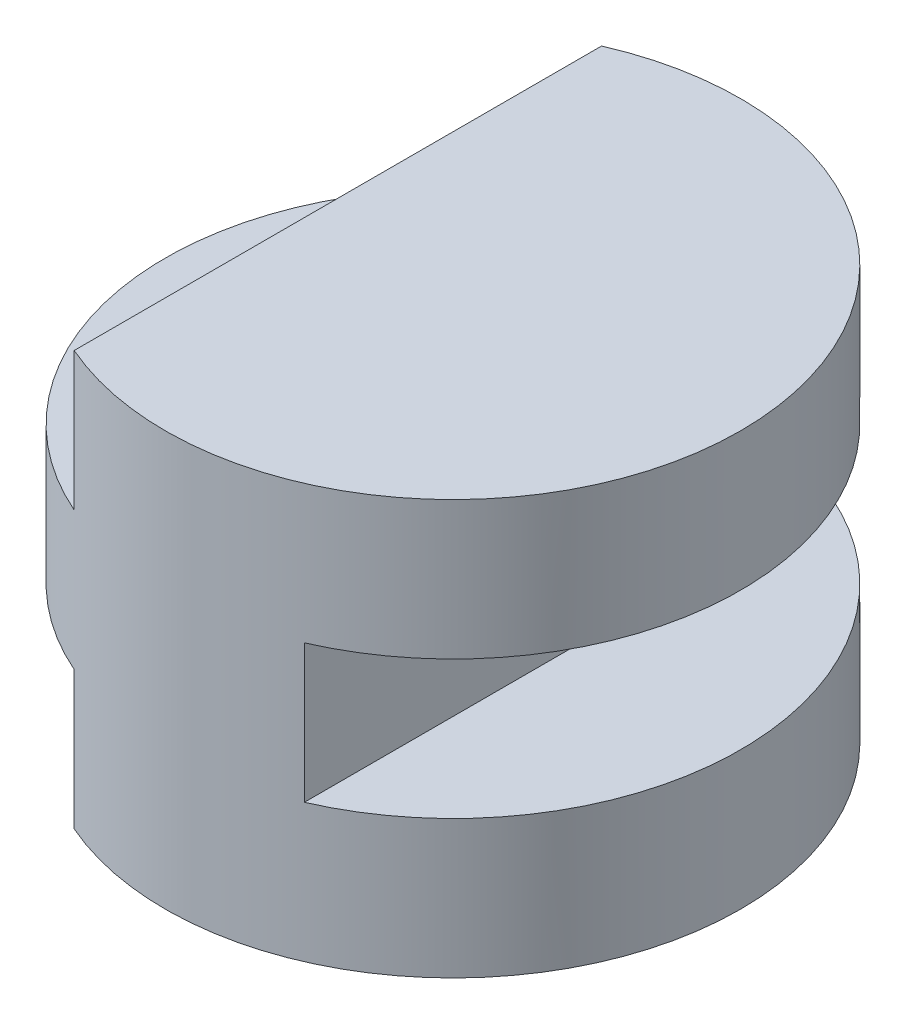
ISO-10303-21;
HEADER;
FILE_DESCRIPTION(('STEP AP214'),'2;1');
FILE_NAME('part.step','',(''),(''),'','','');
FILE_SCHEMA(('AUTOMOTIVE_DESIGN { 1 0 10303 214 1 1 1 1 }'));
ENDSEC;
DATA;
#1=APPLICATION_CONTEXT('core data for automotive mechanical design processes');
#2=APPLICATION_PROTOCOL_DEFINITION('international standard','automotive_design',2000,#1);
#3=PRODUCT_CONTEXT('',#1,'mechanical');
#4=PRODUCT('Part','Part','',(#3));
#5=PRODUCT_RELATED_PRODUCT_CATEGORY('part','',(#4));
#6=PRODUCT_DEFINITION_FORMATION('','',#4);
#7=PRODUCT_DEFINITION_CONTEXT('part definition',#1,'design');
#8=PRODUCT_DEFINITION('design','',#6,#7);
#9=PRODUCT_DEFINITION_SHAPE('','',#8);
#10=(LENGTH_UNIT() NAMED_UNIT(*) SI_UNIT(.MILLI.,.METRE.));
#11=(NAMED_UNIT(*) PLANE_ANGLE_UNIT() SI_UNIT($,.RADIAN.));
#12=(NAMED_UNIT(*) SI_UNIT($,.STERADIAN.) SOLID_ANGLE_UNIT());
#13=UNCERTAINTY_MEASURE_WITH_UNIT(LENGTH_MEASURE(1.E-05),#10,'distance_accuracy_value','');
#14=(GEOMETRIC_REPRESENTATION_CONTEXT(3) GLOBAL_UNCERTAINTY_ASSIGNED_CONTEXT((#13)) GLOBAL_UNIT_ASSIGNED_CONTEXT((#10,
#11,#12)) REPRESENTATION_CONTEXT('',''));
#15=CARTESIAN_POINT('',(0.,0.,0.));
#16=DIRECTION('',(0.,0.,1.));
#17=DIRECTION('',(1.,0.,0.));
#18=AXIS2_PLACEMENT_3D('',#15,#16,#17);
#19=CARTESIAN_POINT('',(0.,72.,0.));
#20=DIRECTION('',(0.,-1.,0.));
#21=DIRECTION('',(0.,0.,-1.));
#22=AXIS2_PLACEMENT_3D('',#19,#20,#21);
#23=CYLINDRICAL_SURFACE('',#22,50.);
#24=CARTESIAN_POINT('',(0.,72.,0.));
#25=DIRECTION('',(0.,1.,0.));
#26=DIRECTION('',(0.,0.,1.));
#27=AXIS2_PLACEMENT_3D('',#24,#25,#26);
#28=CIRCLE('',#27,50.);
#29=CARTESIAN_POINT('',(-20.,72.,45.8257569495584));
#30=VERTEX_POINT('',#29);
#31=CARTESIAN_POINT('',(-20.,72.,-45.8257569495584));
#32=VERTEX_POINT('',#31);
#33=EDGE_CURVE('E108',#30,#32,#28,.T.);
#34=ORIENTED_EDGE('',*,*,#33,.F.);
#35=DIRECTION('',(0.,-1.,0.));
#36=VECTOR('',#35,1.);
#37=CARTESIAN_POINT('',(-20.,72.,45.8257569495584));
#38=LINE('',#37,#36);
#39=CARTESIAN_POINT('',(-20.,48.,45.8257569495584));
#40=VERTEX_POINT('',#39);
#41=EDGE_CURVE('E53',#30,#40,#38,.T.);
#42=ORIENTED_EDGE('',*,*,#41,.T.);
#43=CARTESIAN_POINT('',(0.,48.,0.));
#44=DIRECTION('',(0.,-1.,0.));
#45=DIRECTION('',(0.,0.,-1.));
#46=AXIS2_PLACEMENT_3D('',#43,#44,#45);
#47=CIRCLE('',#46,50.);
#48=CARTESIAN_POINT('',(-20.,48.,-45.8257569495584));
#49=VERTEX_POINT('',#48);
#50=EDGE_CURVE('E126',#40,#49,#47,.T.);
#51=ORIENTED_EDGE('',*,*,#50,.T.);
#52=DIRECTION('',(0.,-1.,0.));
#53=VECTOR('',#52,1.);
#54=CARTESIAN_POINT('',(-20.,72.,-45.8257569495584));
#55=LINE('',#54,#53);
#56=EDGE_CURVE('E99',#49,#32,#55,.F.);
#57=ORIENTED_EDGE('',*,*,#56,.T.);
#58=EDGE_LOOP('',(#34,#42,#51,#57));
#59=FACE_BOUND('',#58,.T.);
#60=DIRECTION('',(0.,-1.,0.));
#61=VECTOR('',#60,1.);
#62=CARTESIAN_POINT('',(20.,72.,45.8257569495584));
#63=LINE('',#62,#61);
#64=CARTESIAN_POINT('',(20.,24.,45.8257569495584));
#65=VERTEX_POINT('',#64);
#66=CARTESIAN_POINT('',(20.,48.,45.8257569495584));
#67=VERTEX_POINT('',#66);
#68=EDGE_CURVE('E115',#65,#67,#63,.F.);
#69=ORIENTED_EDGE('',*,*,#68,.T.);
#70=CARTESIAN_POINT('',(0.,48.,0.));
#71=DIRECTION('',(0.,1.,0.));
#72=DIRECTION('',(0.,0.,1.));
#73=AXIS2_PLACEMENT_3D('',#70,#71,#72);
#74=CIRCLE('',#73,50.);
#75=CARTESIAN_POINT('',(20.,48.,-45.8257569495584));
#76=VERTEX_POINT('',#75);
#77=EDGE_CURVE('E121',#67,#76,#74,.T.);
#78=ORIENTED_EDGE('',*,*,#77,.T.);
#79=DIRECTION('',(0.,-1.,0.));
#80=VECTOR('',#79,1.);
#81=CARTESIAN_POINT('',(20.,72.,-45.8257569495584));
#82=LINE('',#81,#80);
#83=CARTESIAN_POINT('',(20.,24.,-45.8257569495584));
#84=VERTEX_POINT('',#83);
#85=EDGE_CURVE('E118',#76,#84,#82,.T.);
#86=ORIENTED_EDGE('',*,*,#85,.T.);
#87=CARTESIAN_POINT('',(0.,24.,0.));
#88=DIRECTION('',(0.,-1.,0.));
#89=DIRECTION('',(1.,0.,0.));
#90=AXIS2_PLACEMENT_3D('',#87,#88,#89);
#91=CIRCLE('',#90,50.);
#92=EDGE_CURVE('E111',#84,#65,#91,.T.);
#93=ORIENTED_EDGE('',*,*,#92,.T.);
#94=EDGE_LOOP('',(#69,#78,#86,#93));
#95=FACE_BOUND('',#94,.T.);
#96=CARTESIAN_POINT('',(0.,24.,0.));
#97=DIRECTION('',(0.,1.,0.));
#98=DIRECTION('',(-1.,0.,0.));
#99=AXIS2_PLACEMENT_3D('',#96,#97,#98);
#100=CIRCLE('',#99,50.);
#101=CARTESIAN_POINT('',(-20.,24.,-45.8257569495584));
#102=VERTEX_POINT('',#101);
#103=CARTESIAN_POINT('',(-20.,24.,45.8257569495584));
#104=VERTEX_POINT('',#103);
#105=EDGE_CURVE('E11',#102,#104,#100,.T.);
#106=ORIENTED_EDGE('',*,*,#105,.T.);
#107=DIRECTION('',(0.,-1.,0.));
#108=VECTOR('',#107,1.);
#109=CARTESIAN_POINT('',(-20.,72.,45.8257569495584));
#110=LINE('',#109,#108);
#111=CARTESIAN_POINT('',(-20.,0.,45.8257569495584));
#112=VERTEX_POINT('',#111);
#113=EDGE_CURVE('E89',#104,#112,#110,.T.);
#114=ORIENTED_EDGE('',*,*,#113,.T.);
#115=CARTESIAN_POINT('',(0.,0.,0.));
#116=DIRECTION('',(0.,1.,0.));
#117=DIRECTION('',(0.,0.,1.));
#118=AXIS2_PLACEMENT_3D('',#115,#116,#117);
#119=CIRCLE('',#118,50.);
#120=CARTESIAN_POINT('',(-20.,0.,-45.8257569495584));
#121=VERTEX_POINT('',#120);
#122=EDGE_CURVE('E93',#112,#121,#119,.T.);
#123=ORIENTED_EDGE('',*,*,#122,.T.);
#124=DIRECTION('',(0.,-1.,0.));
#125=VECTOR('',#124,1.);
#126=CARTESIAN_POINT('',(-20.,72.,-45.8257569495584));
#127=LINE('',#126,#125);
#128=EDGE_CURVE('E45',#121,#102,#127,.F.);
#129=ORIENTED_EDGE('',*,*,#128,.T.);
#130=EDGE_LOOP('',(#106,#114,#123,#129));
#131=FACE_BOUND('',#130,.T.);
#132=ADVANCED_FACE('F31',(#59,#95,#131),#23,.T.);
#133=CARTESIAN_POINT('',(0.,72.,0.));
#134=DIRECTION('',(0.,1.,0.));
#135=DIRECTION('',(0.,0.,1.));
#136=AXIS2_PLACEMENT_3D('',#133,#134,#135);
#137=PLANE('',#136);
#138=DIRECTION('',(0.,0.,-1.));
#139=VECTOR('',#138,1.);
#140=CARTESIAN_POINT('',(-20.,72.,0.));
#141=LINE('',#140,#139);
#142=EDGE_CURVE('E124',#30,#32,#141,.T.);
#143=ORIENTED_EDGE('',*,*,#142,.F.);
#144=ORIENTED_EDGE('',*,*,#33,.T.);
#145=EDGE_LOOP('',(#143,#144));
#146=FACE_BOUND('',#145,.T.);
#147=ADVANCED_FACE('F132',(#146),#137,.T.);
#148=CARTESIAN_POINT('',(0.,0.,0.));
#149=DIRECTION('',(0.,1.,0.));
#150=DIRECTION('',(0.,0.,1.));
#151=AXIS2_PLACEMENT_3D('',#148,#149,#150);
#152=PLANE('',#151);
#153=ORIENTED_EDGE('',*,*,#122,.F.);
#154=DIRECTION('',(0.,0.,-1.));
#155=VECTOR('',#154,1.);
#156=CARTESIAN_POINT('',(-20.,0.,0.));
#157=LINE('',#156,#155);
#158=EDGE_CURVE('E38',#112,#121,#157,.T.);
#159=ORIENTED_EDGE('',*,*,#158,.T.);
#160=EDGE_LOOP('',(#153,#159));
#161=FACE_BOUND('',#160,.T.);
#162=ADVANCED_FACE('F129',(#161),#152,.F.);
#163=CARTESIAN_POINT('',(20.,48.,-50.));
#164=DIRECTION('',(-1.,0.,0.));
#165=DIRECTION('',(0.,-1.,0.));
#166=AXIS2_PLACEMENT_3D('',#163,#164,#165);
#167=PLANE('',#166);
#168=DIRECTION('',(0.,0.,1.));
#169=VECTOR('',#168,1.);
#170=CARTESIAN_POINT('',(20.,48.,-50.));
#171=LINE('',#170,#169);
#172=EDGE_CURVE('E104',#76,#67,#171,.T.);
#173=ORIENTED_EDGE('',*,*,#172,.T.);
#174=ORIENTED_EDGE('',*,*,#68,.F.);
#175=DIRECTION('',(0.,0.,1.));
#176=VECTOR('',#175,1.);
#177=CARTESIAN_POINT('',(20.,24.,-50.));
#178=LINE('',#177,#176);
#179=EDGE_CURVE('E103',#84,#65,#178,.T.);
#180=ORIENTED_EDGE('',*,*,#179,.F.);
#181=ORIENTED_EDGE('',*,*,#85,.F.);
#182=EDGE_LOOP('',(#173,#174,#180,#181));
#183=FACE_BOUND('',#182,.T.);
#184=ADVANCED_FACE('F131',(#183),#167,.F.);
#185=CARTESIAN_POINT('',(20.,48.,-50.));
#186=DIRECTION('',(0.,1.,0.));
#187=DIRECTION('',(0.,0.,1.));
#188=AXIS2_PLACEMENT_3D('',#185,#186,#187);
#189=PLANE('',#188);
#190=ORIENTED_EDGE('',*,*,#172,.F.);
#191=ORIENTED_EDGE('',*,*,#77,.F.);
#192=EDGE_LOOP('',(#190,#191));
#193=FACE_BOUND('',#192,.T.);
#194=ADVANCED_FACE('F137',(#193),#189,.F.);
#195=CARTESIAN_POINT('',(20.,24.,-50.));
#196=DIRECTION('',(0.,-1.,0.));
#197=DIRECTION('',(1.,0.,0.));
#198=AXIS2_PLACEMENT_3D('',#195,#196,#197);
#199=PLANE('',#198);
#200=ORIENTED_EDGE('',*,*,#179,.T.);
#201=ORIENTED_EDGE('',*,*,#92,.F.);
#202=EDGE_LOOP('',(#200,#201));
#203=FACE_BOUND('',#202,.T.);
#204=ADVANCED_FACE('F153',(#203),#199,.F.);
#205=CARTESIAN_POINT('',(-74.0229885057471,48.,-50.));
#206=DIRECTION('',(0.,-1.,0.));
#207=DIRECTION('',(0.,0.,-1.));
#208=AXIS2_PLACEMENT_3D('',#205,#206,#207);
#209=PLANE('',#208);
#210=DIRECTION('',(0.,0.,1.));
#211=VECTOR('',#210,1.);
#212=CARTESIAN_POINT('',(-20.,48.,-50.));
#213=LINE('',#212,#211);
#214=EDGE_CURVE('E95',#49,#40,#213,.T.);
#215=ORIENTED_EDGE('',*,*,#214,.F.);
#216=ORIENTED_EDGE('',*,*,#50,.F.);
#217=EDGE_LOOP('',(#215,#216));
#218=FACE_BOUND('',#217,.T.);
#219=ADVANCED_FACE('F158',(#218),#209,.F.);
#220=CARTESIAN_POINT('',(-20.,78.5747126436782,-50.));
#221=DIRECTION('',(1.,0.,0.));
#222=DIRECTION('',(0.,1.,0.));
#223=AXIS2_PLACEMENT_3D('',#220,#221,#222);
#224=PLANE('',#223);
#225=ORIENTED_EDGE('',*,*,#142,.T.);
#226=ORIENTED_EDGE('',*,*,#56,.F.);
#227=ORIENTED_EDGE('',*,*,#214,.T.);
#228=ORIENTED_EDGE('',*,*,#41,.F.);
#229=EDGE_LOOP('',(#225,#226,#227,#228));
#230=FACE_BOUND('',#229,.T.);
#231=ADVANCED_FACE('F164',(#230),#224,.F.);
#232=CARTESIAN_POINT('',(-74.0229885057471,24.,-50.));
#233=DIRECTION('',(0.,1.,0.));
#234=DIRECTION('',(-1.,0.,0.));
#235=AXIS2_PLACEMENT_3D('',#232,#233,#234);
#236=PLANE('',#235);
#237=DIRECTION('',(0.,0.,1.));
#238=VECTOR('',#237,1.);
#239=CARTESIAN_POINT('',(-20.,24.,-50.));
#240=LINE('',#239,#238);
#241=EDGE_CURVE('E85',#102,#104,#240,.T.);
#242=ORIENTED_EDGE('',*,*,#241,.T.);
#243=ORIENTED_EDGE('',*,*,#105,.F.);
#244=EDGE_LOOP('',(#242,#243));
#245=FACE_BOUND('',#244,.T.);
#246=ADVANCED_FACE('F84',(#245),#236,.F.);
#247=CARTESIAN_POINT('',(-20.,-6.57471264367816,-50.));
#248=DIRECTION('',(1.,0.,0.));
#249=DIRECTION('',(0.,1.,0.));
#250=AXIS2_PLACEMENT_3D('',#247,#248,#249);
#251=PLANE('',#250);
#252=ORIENTED_EDGE('',*,*,#241,.F.);
#253=ORIENTED_EDGE('',*,*,#128,.F.);
#254=ORIENTED_EDGE('',*,*,#158,.F.);
#255=ORIENTED_EDGE('',*,*,#113,.F.);
#256=EDGE_LOOP('',(#252,#253,#254,#255));
#257=FACE_BOUND('',#256,.T.);
#258=ADVANCED_FACE('F88',(#257),#251,.F.);
#259=CLOSED_SHELL('',(#132,#147,#162,#184,#194,#204,#219,#231,#246,#258));
#260=MANIFOLD_SOLID_BREP('B2',#259);
#261=ADVANCED_BREP_SHAPE_REPRESENTATION('',(#18,#260),#14);
#262=SHAPE_DEFINITION_REPRESENTATION(#9,#261);
ENDSEC;
END-ISO-10303-21;
